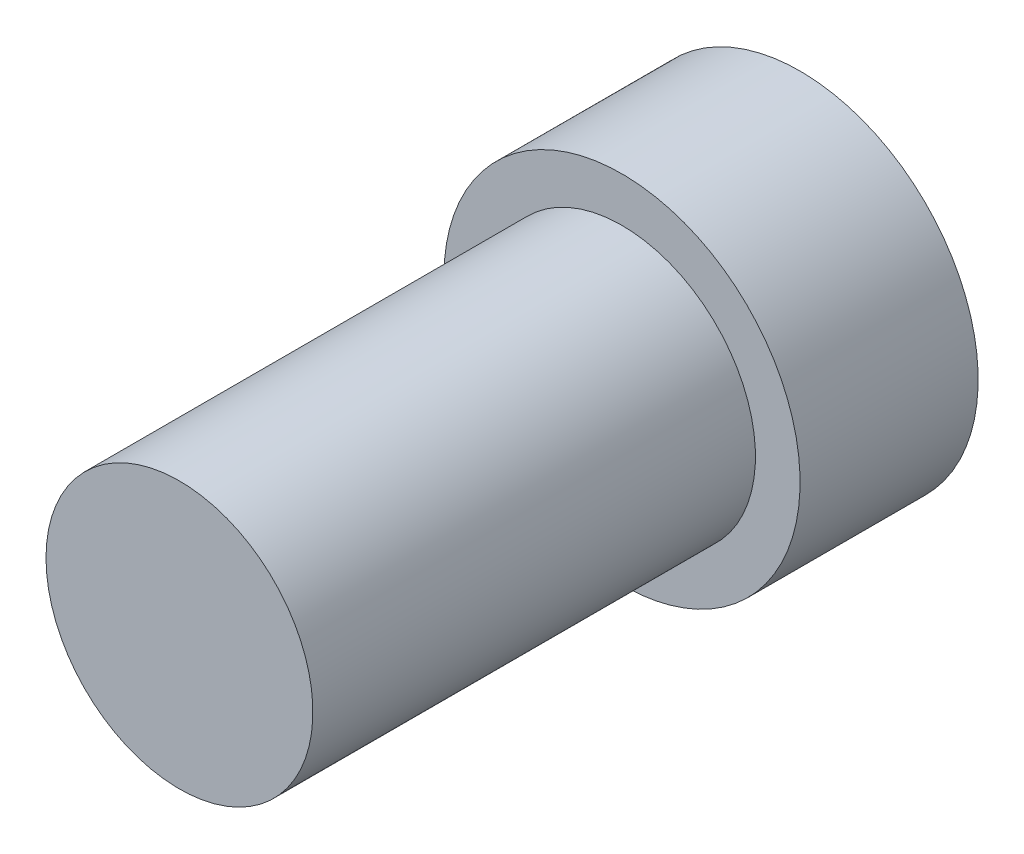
from build123d import *


with BuildPart() as part:
    # Logo3_bib1 → Revolve1 (revolve)
    with BuildSketch(Plane(origin=(0, 0, 0), x_dir=(-1, 0, 0), z_dir=(0, -1, 0))):
        Polygon((7.1374, 0), (9.525, 0), (9.525, 9.525), (0, 9.525), (0, -23.6728), (7.1374, -23.6728), align=None)
    revolve(axis=Axis((0, 0, -16.546754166), (0, 0, 1)))


solid = part.part
